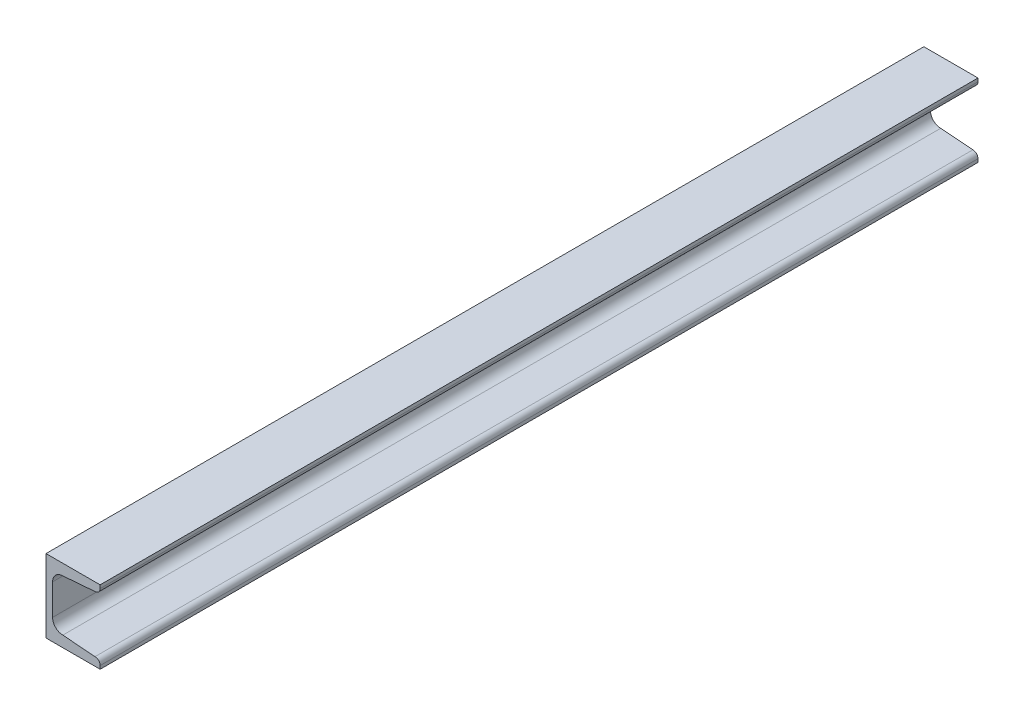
from build123d import *

# Parameters (mm, degrees)
EXTRUDE_1_DEPTH = 600


with BuildPart() as part:
    # Sketch 1 → Extrude 1 (new body)
    with BuildSketch(Plane.XY):
        with BuildLine():
            Line((4.5, 35.525), (4.5, 14.475))
            ThreePointArc((4.5, 14.475), (6.550252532, 9.525252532), (11.5, 7.475))
            Line((11.5, 7.475), (33.5, 5.725))
            ThreePointArc((33.5, 5.725), (35.974873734, 4.699873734), (37, 2.225))
            Line((37, 2.225), (37, 0))
            Line((37, 0), (0, 0))
            Line((0, 0), (0, 50))
            Line((0, 50), (37, 50))
            Line((37, 50), (37, 47.775))
            ThreePointArc((37, 47.775), (35.974873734, 45.300126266), (33.5, 44.275))
            Line((33.5, 44.275), (11.5, 42.525))
            ThreePointArc((11.5, 42.525), (6.550252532, 40.474747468), (4.5, 35.525))
        make_face()
        with BuildLine():
            Line((0, 50), (0, 25))
            Line((0, 25), (4.5, 25))
            Line((4.5, 25), (4.5, 35.525))
            ThreePointArc((4.5, 35.525), (6.550252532, 40.474747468), (11.5, 42.525))
            Line((11.5, 42.525), (33.5, 44.275))
            ThreePointArc((33.5, 44.275), (35.974873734, 45.300126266), (37, 47.775))
            Line((37, 47.775), (37, 50))
            Line((37, 50), (0, 50))
        make_face()
    extrude(amount=EXTRUDE_1_DEPTH)


solid = part.part
